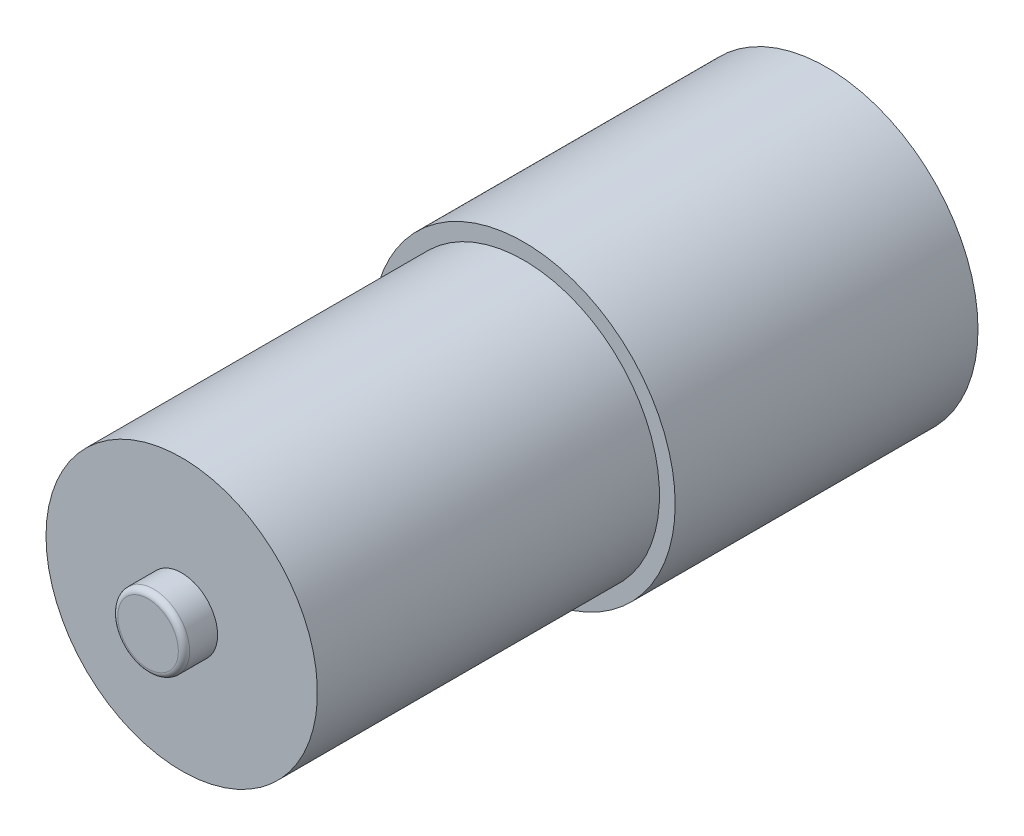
from build123d import *

# Parameters (mm, degrees)
SKETCH2_R           = 12.1
BOSS_EXTRUDE1_DEPTH = 30.5
SKETCH3_R           = 13.5
BOSS_EXTRUDE2_DEPTH = 27
SKETCH4_R           = 2.1
BOSS_EXTRUDE3_DEPTH = 6.3
CHAMFER1_SIZE       = 0.5
SKETCH5_R           = 3.2
BOSS_EXTRUDE4_DEPTH = 3
FILLET1_R           = 0.5


with BuildPart() as part:
    # Sketch2 → Boss-Extrude1 (new body)
    with BuildSketch(Plane.XY):
        with Locations(Location((0, 0, 0), (0, 0, 180))):
            Circle(SKETCH2_R)
    extrude(amount=BOSS_EXTRUDE1_DEPTH)

    # Sketch3 → Boss-Extrude2 (add)
    with BuildSketch(Plane(origin=(0, 0, 0), x_dir=(-1, 0, 0), z_dir=(0, 0, -1))):
        Circle(SKETCH3_R)
    extrude(amount=BOSS_EXTRUDE2_DEPTH)

    # Sketch4 → Boss-Extrude3 (add)
    with BuildSketch(Plane(origin=(0, 0, -27), x_dir=(-1, 0, 0), z_dir=(0, 0, -1))):
        Circle(SKETCH4_R)
    extrude(amount=BOSS_EXTRUDE3_DEPTH)

    # Chamfer1
    chamfer1_edges = [part.edges().sort_by_distance(p)[0] for p in [
        (2.1, 0, -33.3),
        (2.1, 0, -27),
    ]]
    chamfer(chamfer1_edges, length=CHAMFER1_SIZE)

    # Sketch5 → Boss-Extrude4 (add)
    with BuildSketch(Plane.XY.offset(30.5)):
        Circle(SKETCH5_R)
    extrude(amount=BOSS_EXTRUDE4_DEPTH)

    # Fillet1
    fillet1_edges = [part.edges().sort_by_distance(p)[0] for p in [
        (-3.2, 0, 33.5),
    ]]
    fillet(fillet1_edges, radius=FILLET1_R)


solid = part.part
